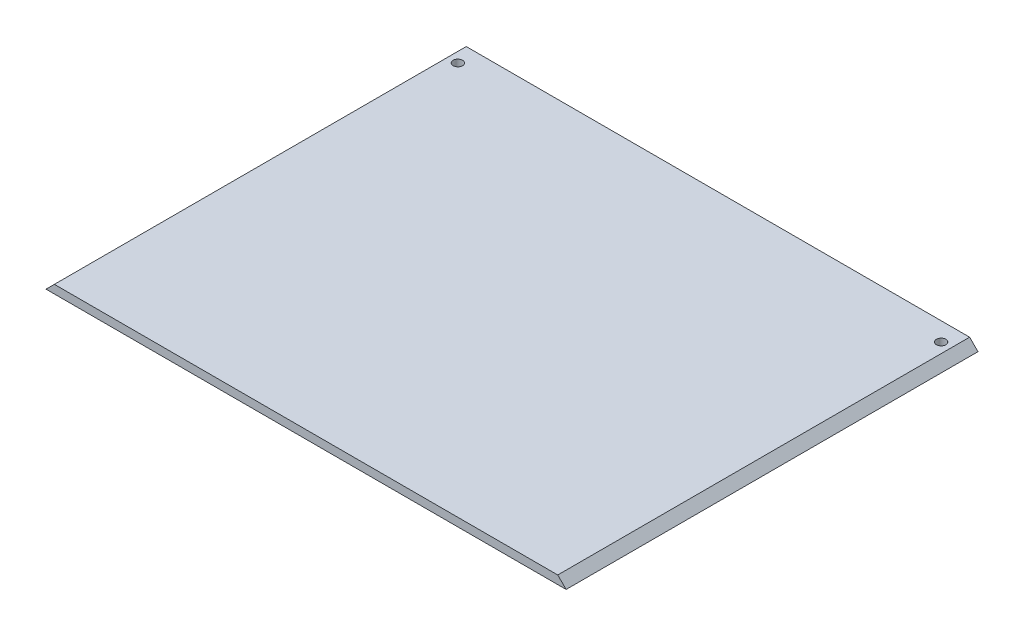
ISO-10303-21;
HEADER;
FILE_DESCRIPTION(('STEP AP214'),'2;1');
FILE_NAME('part.step','',(''),(''),'','','');
FILE_SCHEMA(('AUTOMOTIVE_DESIGN { 1 0 10303 214 1 1 1 1 }'));
ENDSEC;
DATA;
#1=APPLICATION_CONTEXT('core data for automotive mechanical design processes');
#2=APPLICATION_PROTOCOL_DEFINITION('international standard','automotive_design',2000,#1);
#3=PRODUCT_CONTEXT('',#1,'mechanical');
#4=PRODUCT('Part','Part','',(#3));
#5=PRODUCT_RELATED_PRODUCT_CATEGORY('part','',(#4));
#6=PRODUCT_DEFINITION_FORMATION('','',#4);
#7=PRODUCT_DEFINITION_CONTEXT('part definition',#1,'design');
#8=PRODUCT_DEFINITION('design','',#6,#7);
#9=PRODUCT_DEFINITION_SHAPE('','',#8);
#10=(LENGTH_UNIT() NAMED_UNIT(*) SI_UNIT(.MILLI.,.METRE.));
#11=(NAMED_UNIT(*) PLANE_ANGLE_UNIT() SI_UNIT($,.RADIAN.));
#12=(NAMED_UNIT(*) SI_UNIT($,.STERADIAN.) SOLID_ANGLE_UNIT());
#13=UNCERTAINTY_MEASURE_WITH_UNIT(LENGTH_MEASURE(1.E-05),#10,'distance_accuracy_value','');
#14=(GEOMETRIC_REPRESENTATION_CONTEXT(3) GLOBAL_UNCERTAINTY_ASSIGNED_CONTEXT((#13)) GLOBAL_UNIT_ASSIGNED_CONTEXT((#10,
#11,#12)) REPRESENTATION_CONTEXT('',''));
#15=CARTESIAN_POINT('',(0.,0.,0.));
#16=DIRECTION('',(0.,0.,1.));
#17=DIRECTION('',(1.,0.,0.));
#18=AXIS2_PLACEMENT_3D('',#15,#16,#17);
#19=CARTESIAN_POINT('',(0.,-3.,-147.6));
#20=DIRECTION('',(0.,0.,-1.));
#21=DIRECTION('',(-1.,0.,0.));
#22=AXIS2_PLACEMENT_3D('',#19,#20,#21);
#23=PLANE('',#22);
#24=DIRECTION('',(-1.,0.,0.));
#25=VECTOR('',#24,1.);
#26=CARTESIAN_POINT('',(0.,0.,-147.6));
#27=LINE('',#26,#25);
#28=CARTESIAN_POINT('',(183.4,0.,-147.6));
#29=VERTEX_POINT('',#28);
#30=CARTESIAN_POINT('',(3.,0.,-147.6));
#31=VERTEX_POINT('',#30);
#32=EDGE_CURVE('E43',#29,#31,#27,.T.);
#33=ORIENTED_EDGE('',*,*,#32,.F.);
#34=DIRECTION('',(-0.707106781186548,0.707106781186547,0.));
#35=VECTOR('',#34,1.);
#36=CARTESIAN_POINT('',(91.6999999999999,91.7,-147.6));
#37=LINE('',#36,#35);
#38=CARTESIAN_POINT('',(186.4,-3.,-147.6));
#39=VERTEX_POINT('',#38);
#40=EDGE_CURVE('E57',#39,#29,#37,.T.);
#41=ORIENTED_EDGE('',*,*,#40,.F.);
#42=DIRECTION('',(-1.,0.,0.));
#43=VECTOR('',#42,1.);
#44=CARTESIAN_POINT('',(0.,-3.,-147.6));
#45=LINE('',#44,#43);
#46=CARTESIAN_POINT('',(0.,-3.,-147.6));
#47=VERTEX_POINT('',#46);
#48=EDGE_CURVE('E11',#39,#47,#45,.T.);
#49=ORIENTED_EDGE('',*,*,#48,.T.);
#50=DIRECTION('',(-0.707106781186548,-0.707106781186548,0.));
#51=VECTOR('',#50,1.);
#52=CARTESIAN_POINT('',(1.5,-1.5,-147.6));
#53=LINE('',#52,#51);
#54=EDGE_CURVE('E122',#31,#47,#53,.T.);
#55=ORIENTED_EDGE('',*,*,#54,.F.);
#56=EDGE_LOOP('',(#33,#41,#49,#55));
#57=FACE_BOUND('',#56,.T.);
#58=ADVANCED_FACE('F39',(#57),#23,.T.);
#59=CARTESIAN_POINT('',(0.,-3.,0.));
#60=DIRECTION('',(0.,0.,1.));
#61=DIRECTION('',(1.,0.,0.));
#62=AXIS2_PLACEMENT_3D('',#59,#60,#61);
#63=PLANE('',#62);
#64=DIRECTION('',(1.,0.,0.));
#65=VECTOR('',#64,1.);
#66=CARTESIAN_POINT('',(0.,-3.,0.));
#67=LINE('',#66,#65);
#68=CARTESIAN_POINT('',(0.,-3.,0.));
#69=VERTEX_POINT('',#68);
#70=CARTESIAN_POINT('',(186.4,-3.,0.));
#71=VERTEX_POINT('',#70);
#72=EDGE_CURVE('E89',#69,#71,#67,.T.);
#73=ORIENTED_EDGE('',*,*,#72,.T.);
#74=DIRECTION('',(-0.707106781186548,0.707106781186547,0.));
#75=VECTOR('',#74,1.);
#76=CARTESIAN_POINT('',(93.1999999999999,90.2,0.));
#77=LINE('',#76,#75);
#78=CARTESIAN_POINT('',(183.4,0.,0.));
#79=VERTEX_POINT('',#78);
#80=EDGE_CURVE('E83',#71,#79,#77,.T.);
#81=ORIENTED_EDGE('',*,*,#80,.T.);
#82=DIRECTION('',(1.,0.,0.));
#83=VECTOR('',#82,1.);
#84=CARTESIAN_POINT('',(0.,0.,0.));
#85=LINE('',#84,#83);
#86=CARTESIAN_POINT('',(3.,0.,0.));
#87=VERTEX_POINT('',#86);
#88=EDGE_CURVE('E107',#87,#79,#85,.T.);
#89=ORIENTED_EDGE('',*,*,#88,.F.);
#90=DIRECTION('',(-0.707106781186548,-0.707106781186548,0.));
#91=VECTOR('',#90,1.);
#92=CARTESIAN_POINT('',(0.,-3.,0.));
#93=LINE('',#92,#91);
#94=EDGE_CURVE('E65',#87,#69,#93,.T.);
#95=ORIENTED_EDGE('',*,*,#94,.T.);
#96=EDGE_LOOP('',(#73,#81,#89,#95));
#97=FACE_BOUND('',#96,.T.);
#98=ADVANCED_FACE('F41',(#97),#63,.T.);
#99=CARTESIAN_POINT('',(0.,0.,0.));
#100=DIRECTION('',(0.,-1.,0.));
#101=DIRECTION('',(0.,0.,-1.));
#102=AXIS2_PLACEMENT_3D('',#99,#100,#101);
#103=PLANE('',#102);
#104=CARTESIAN_POINT('',(6.6,0.,-141.));
#105=DIRECTION('',(0.,1.,0.));
#106=DIRECTION('',(0.,0.,1.));
#107=AXIS2_PLACEMENT_3D('',#104,#105,#106);
#108=CIRCLE('',#107,1.69999999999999);
#109=CARTESIAN_POINT('',(6.6,0.,-139.3));
#110=VERTEX_POINT('',#109);
#111=EDGE_CURVE('E137',#110,#110,#108,.T.);
#112=ORIENTED_EDGE('',*,*,#111,.F.);
#113=EDGE_LOOP('',(#112));
#114=FACE_BOUND('',#113,.T.);
#115=CARTESIAN_POINT('',(179.8,0.,-141.));
#116=DIRECTION('',(0.,1.,0.));
#117=DIRECTION('',(0.,0.,1.));
#118=AXIS2_PLACEMENT_3D('',#115,#116,#117);
#119=CIRCLE('',#118,1.69999999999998);
#120=CARTESIAN_POINT('',(179.8,0.,-139.3));
#121=VERTEX_POINT('',#120);
#122=EDGE_CURVE('E129',#121,#121,#119,.T.);
#123=ORIENTED_EDGE('',*,*,#122,.F.);
#124=EDGE_LOOP('',(#123));
#125=FACE_BOUND('',#124,.T.);
#126=DIRECTION('',(0.,0.,1.));
#127=VECTOR('',#126,1.);
#128=CARTESIAN_POINT('',(183.4,0.,-147.6));
#129=LINE('',#128,#127);
#130=EDGE_CURVE('E96',#29,#79,#129,.T.);
#131=ORIENTED_EDGE('',*,*,#130,.F.);
#132=ORIENTED_EDGE('',*,*,#32,.T.);
#133=DIRECTION('',(0.,0.,1.));
#134=VECTOR('',#133,1.);
#135=CARTESIAN_POINT('',(3.,0.,-147.6));
#136=LINE('',#135,#134);
#137=EDGE_CURVE('E97',#31,#87,#136,.T.);
#138=ORIENTED_EDGE('',*,*,#137,.T.);
#139=ORIENTED_EDGE('',*,*,#88,.T.);
#140=EDGE_LOOP('',(#131,#132,#138,#139));
#141=FACE_BOUND('',#140,.T.);
#142=ADVANCED_FACE('F144',(#114,#125,#141),#103,.F.);
#143=CARTESIAN_POINT('',(0.,-3.,0.));
#144=DIRECTION('',(0.,-1.,0.));
#145=DIRECTION('',(0.,0.,-1.));
#146=AXIS2_PLACEMENT_3D('',#143,#144,#145);
#147=PLANE('',#146);
#148=CARTESIAN_POINT('',(6.6,-3.,-141.));
#149=DIRECTION('',(0.,1.,0.));
#150=DIRECTION('',(0.,0.,1.));
#151=AXIS2_PLACEMENT_3D('',#148,#149,#150);
#152=CIRCLE('',#151,1.7);
#153=CARTESIAN_POINT('',(6.6,-3.,-139.3));
#154=VERTEX_POINT('',#153);
#155=EDGE_CURVE('E133',#154,#154,#152,.T.);
#156=ORIENTED_EDGE('',*,*,#155,.T.);
#157=EDGE_LOOP('',(#156));
#158=FACE_BOUND('',#157,.T.);
#159=CARTESIAN_POINT('',(179.8,-3.,-141.));
#160=DIRECTION('',(0.,1.,0.));
#161=DIRECTION('',(0.,0.,1.));
#162=AXIS2_PLACEMENT_3D('',#159,#160,#161);
#163=CIRCLE('',#162,1.70000000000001);
#164=CARTESIAN_POINT('',(179.8,-3.,-139.3));
#165=VERTEX_POINT('',#164);
#166=EDGE_CURVE('E124',#165,#165,#163,.T.);
#167=ORIENTED_EDGE('',*,*,#166,.T.);
#168=EDGE_LOOP('',(#167));
#169=FACE_BOUND('',#168,.T.);
#170=DIRECTION('',(0.,0.,1.));
#171=VECTOR('',#170,1.);
#172=CARTESIAN_POINT('',(0.,-3.,0.));
#173=LINE('',#172,#171);
#174=EDGE_CURVE('E101',#47,#69,#173,.T.);
#175=ORIENTED_EDGE('',*,*,#174,.F.);
#176=ORIENTED_EDGE('',*,*,#48,.F.);
#177=DIRECTION('',(0.,0.,-1.));
#178=VECTOR('',#177,1.);
#179=CARTESIAN_POINT('',(186.4,-3.,0.));
#180=LINE('',#179,#178);
#181=EDGE_CURVE('E49',#71,#39,#180,.T.);
#182=ORIENTED_EDGE('',*,*,#181,.F.);
#183=ORIENTED_EDGE('',*,*,#72,.F.);
#184=EDGE_LOOP('',(#175,#176,#182,#183));
#185=FACE_BOUND('',#184,.T.);
#186=ADVANCED_FACE('F100',(#158,#169,#185),#147,.T.);
#187=CARTESIAN_POINT('',(1.5,-1.5,-147.6));
#188=DIRECTION('',(-0.707106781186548,0.707106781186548,0.));
#189=DIRECTION('',(-0.707106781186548,-0.707106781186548,0.));
#190=AXIS2_PLACEMENT_3D('',#187,#188,#189);
#191=PLANE('',#190);
#192=ORIENTED_EDGE('',*,*,#137,.F.);
#193=ORIENTED_EDGE('',*,*,#54,.T.);
#194=ORIENTED_EDGE('',*,*,#174,.T.);
#195=ORIENTED_EDGE('',*,*,#94,.F.);
#196=EDGE_LOOP('',(#192,#193,#194,#195));
#197=FACE_BOUND('',#196,.T.);
#198=ADVANCED_FACE('F158',(#197),#191,.T.);
#199=CARTESIAN_POINT('',(91.6999999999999,91.7,-147.6));
#200=DIRECTION('',(0.707106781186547,0.707106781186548,0.));
#201=DIRECTION('',(-0.707106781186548,0.707106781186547,0.));
#202=AXIS2_PLACEMENT_3D('',#199,#200,#201);
#203=PLANE('',#202);
#204=ORIENTED_EDGE('',*,*,#181,.T.);
#205=ORIENTED_EDGE('',*,*,#40,.T.);
#206=ORIENTED_EDGE('',*,*,#130,.T.);
#207=ORIENTED_EDGE('',*,*,#80,.F.);
#208=EDGE_LOOP('',(#204,#205,#206,#207));
#209=FACE_BOUND('',#208,.T.);
#210=ADVANCED_FACE('F81',(#209),#203,.T.);
#211=CARTESIAN_POINT('',(179.8,0.,-141.));
#212=DIRECTION('',(0.,1.,0.));
#213=DIRECTION('',(0.,0.,1.));
#214=AXIS2_PLACEMENT_3D('',#211,#212,#213);
#215=CYLINDRICAL_SURFACE('',#214,1.69999999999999);
#216=ORIENTED_EDGE('',*,*,#166,.F.);
#217=EDGE_LOOP('',(#216));
#218=FACE_BOUND('',#217,.T.);
#219=ORIENTED_EDGE('',*,*,#122,.T.);
#220=EDGE_LOOP('',(#219));
#221=FACE_BOUND('',#220,.T.);
#222=ADVANCED_FACE('F164',(#218,#221),#215,.F.);
#223=CARTESIAN_POINT('',(6.6,0.,-141.));
#224=DIRECTION('',(0.,1.,0.));
#225=DIRECTION('',(0.,0.,1.));
#226=AXIS2_PLACEMENT_3D('',#223,#224,#225);
#227=CYLINDRICAL_SURFACE('',#226,1.69999999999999);
#228=ORIENTED_EDGE('',*,*,#155,.F.);
#229=EDGE_LOOP('',(#228));
#230=FACE_BOUND('',#229,.T.);
#231=ORIENTED_EDGE('',*,*,#111,.T.);
#232=EDGE_LOOP('',(#231));
#233=FACE_BOUND('',#232,.T.);
#234=ADVANCED_FACE('F142',(#230,#233),#227,.F.);
#235=CLOSED_SHELL('',(#58,#98,#142,#186,#198,#210,#222,#234));
#236=MANIFOLD_SOLID_BREP('B2',#235);
#237=ADVANCED_BREP_SHAPE_REPRESENTATION('',(#18,#236),#14);
#238=SHAPE_DEFINITION_REPRESENTATION(#9,#237);
ENDSEC;
END-ISO-10303-21;
